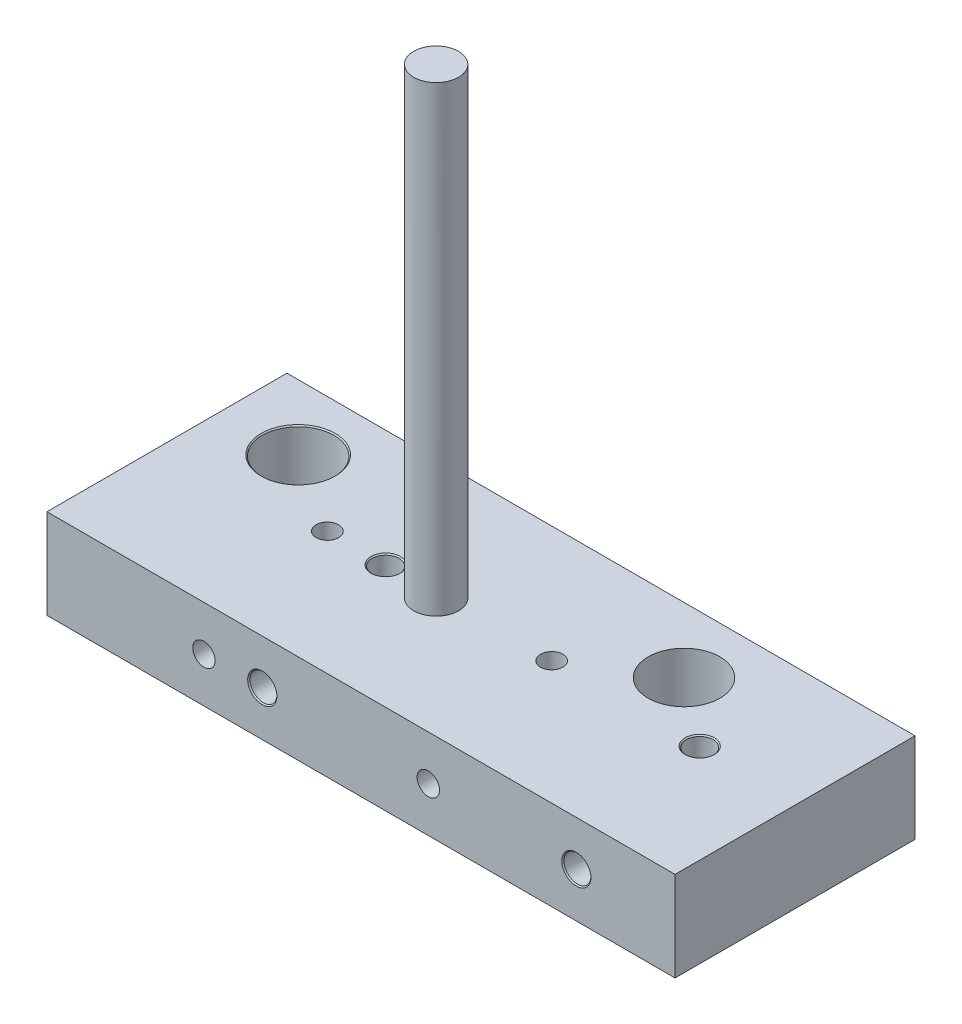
ISO-10303-21;
HEADER;
FILE_DESCRIPTION(('STEP AP214'),'2;1');
FILE_NAME('part.step','',(''),(''),'','','');
FILE_SCHEMA(('AUTOMOTIVE_DESIGN { 1 0 10303 214 1 1 1 1 }'));
ENDSEC;
DATA;
#1=APPLICATION_CONTEXT('core data for automotive mechanical design processes');
#2=APPLICATION_PROTOCOL_DEFINITION('international standard','automotive_design',2000,#1);
#3=PRODUCT_CONTEXT('',#1,'mechanical');
#4=PRODUCT('Part','Part','',(#3));
#5=PRODUCT_RELATED_PRODUCT_CATEGORY('part','',(#4));
#6=PRODUCT_DEFINITION_FORMATION('','',#4);
#7=PRODUCT_DEFINITION_CONTEXT('part definition',#1,'design');
#8=PRODUCT_DEFINITION('design','',#6,#7);
#9=PRODUCT_DEFINITION_SHAPE('','',#8);
#10=(LENGTH_UNIT() NAMED_UNIT(*) SI_UNIT(.MILLI.,.METRE.));
#11=(NAMED_UNIT(*) PLANE_ANGLE_UNIT() SI_UNIT($,.RADIAN.));
#12=(NAMED_UNIT(*) SI_UNIT($,.STERADIAN.) SOLID_ANGLE_UNIT());
#13=UNCERTAINTY_MEASURE_WITH_UNIT(LENGTH_MEASURE(1.E-05),#10,'distance_accuracy_value','');
#14=(GEOMETRIC_REPRESENTATION_CONTEXT(3) GLOBAL_UNCERTAINTY_ASSIGNED_CONTEXT((#13)) GLOBAL_UNIT_ASSIGNED_CONTEXT((#10,
#11,#12)) REPRESENTATION_CONTEXT('',''));
#15=CARTESIAN_POINT('',(0.,0.,0.));
#16=DIRECTION('',(0.,0.,1.));
#17=DIRECTION('',(1.,0.,0.));
#18=AXIS2_PLACEMENT_3D('',#15,#16,#17);
#19=CARTESIAN_POINT('',(0.,20.,-53.5));
#20=DIRECTION('',(0.,-1.,0.));
#21=DIRECTION('',(0.,0.,-1.));
#22=AXIS2_PLACEMENT_3D('',#19,#20,#21);
#23=PLANE('',#22);
#24=CARTESIAN_POINT('',(103.,20.,-39.));
#25=DIRECTION('',(0.,-1.,0.));
#26=DIRECTION('',(0.,0.,-1.));
#27=AXIS2_PLACEMENT_3D('',#24,#25,#26);
#28=CIRCLE('',#27,7.99999999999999);
#29=CARTESIAN_POINT('',(103.,20.,-47.));
#30=VERTEX_POINT('',#29);
#31=EDGE_CURVE('E9178',#30,#30,#28,.T.);
#32=ORIENTED_EDGE('',*,*,#31,.T.);
#33=EDGE_LOOP('',(#32));
#34=FACE_BOUND('',#33,.T.);
#35=DIRECTION('',(0.,0.,1.));
#36=VECTOR('',#35,1.);
#37=CARTESIAN_POINT('',(0.,20.,0.));
#38=LINE('',#37,#36);
#39=CARTESIAN_POINT('',(0.,20.,-53.5));
#40=VERTEX_POINT('',#39);
#41=CARTESIAN_POINT('',(0.,20.,0.));
#42=VERTEX_POINT('',#41);
#43=EDGE_CURVE('E9306',#40,#42,#38,.T.);
#44=ORIENTED_EDGE('',*,*,#43,.T.);
#45=DIRECTION('',(1.,0.,0.));
#46=VECTOR('',#45,1.);
#47=CARTESIAN_POINT('',(0.,20.,0.));
#48=LINE('',#47,#46);
#49=CARTESIAN_POINT('',(140.,20.,0.));
#50=VERTEX_POINT('',#49);
#51=EDGE_CURVE('E9304',#42,#50,#48,.T.);
#52=ORIENTED_EDGE('',*,*,#51,.T.);
#53=DIRECTION('',(0.,0.,-1.));
#54=VECTOR('',#53,1.);
#55=CARTESIAN_POINT('',(140.,20.,0.));
#56=LINE('',#55,#54);
#57=CARTESIAN_POINT('',(140.,20.,-53.5));
#58=VERTEX_POINT('',#57);
#59=EDGE_CURVE('E9302',#50,#58,#56,.T.);
#60=ORIENTED_EDGE('',*,*,#59,.T.);
#61=DIRECTION('',(-1.,0.,0.));
#62=VECTOR('',#61,1.);
#63=CARTESIAN_POINT('',(0.,20.,-53.5));
#64=LINE('',#63,#62);
#65=EDGE_CURVE('E9300',#58,#40,#64,.T.);
#66=ORIENTED_EDGE('',*,*,#65,.T.);
#67=EDGE_LOOP('',(#44,#52,#60,#66));
#68=FACE_BOUND('',#67,.T.);
#69=CARTESIAN_POINT('',(17.,20.,-39.));
#70=DIRECTION('',(0.,-1.,0.));
#71=DIRECTION('',(0.,0.,-1.));
#72=AXIS2_PLACEMENT_3D('',#69,#70,#71);
#73=CIRCLE('',#72,8.24999999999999);
#74=CARTESIAN_POINT('',(17.,20.,-47.25));
#75=VERTEX_POINT('',#74);
#76=EDGE_CURVE('E9327',#75,#75,#73,.T.);
#77=ORIENTED_EDGE('',*,*,#76,.T.);
#78=EDGE_LOOP('',(#77));
#79=FACE_BOUND('',#78,.T.);
#80=CARTESIAN_POINT('',(35.,20.,-27.5));
#81=DIRECTION('',(0.,-1.,0.));
#82=DIRECTION('',(0.,0.,-1.));
#83=AXIS2_PLACEMENT_3D('',#80,#81,#82);
#84=CIRCLE('',#83,2.5);
#85=CARTESIAN_POINT('',(35.,20.,-30.));
#86=VERTEX_POINT('',#85);
#87=EDGE_CURVE('E9333',#86,#86,#84,.T.);
#88=ORIENTED_EDGE('',*,*,#87,.T.);
#89=EDGE_LOOP('',(#88));
#90=FACE_BOUND('',#89,.T.);
#91=CARTESIAN_POINT('',(85.,20.,-27.5));
#92=DIRECTION('',(0.,-1.,0.));
#93=DIRECTION('',(0.,0.,-1.));
#94=AXIS2_PLACEMENT_3D('',#91,#92,#93);
#95=CIRCLE('',#94,2.49999999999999);
#96=CARTESIAN_POINT('',(85.,20.,-30.));
#97=VERTEX_POINT('',#96);
#98=EDGE_CURVE('E9339',#97,#97,#95,.T.);
#99=ORIENTED_EDGE('',*,*,#98,.T.);
#100=EDGE_LOOP('',(#99));
#101=FACE_BOUND('',#100,.T.);
#102=CARTESIAN_POINT('',(48.,20.,-27.5));
#103=DIRECTION('',(0.,-1.,0.));
#104=DIRECTION('',(0.,0.,-1.));
#105=AXIS2_PLACEMENT_3D('',#102,#103,#104);
#106=CIRCLE('',#105,3.25);
#107=CARTESIAN_POINT('',(48.,20.,-30.75));
#108=VERTEX_POINT('',#107);
#109=EDGE_CURVE('E9351',#108,#108,#106,.T.);
#110=ORIENTED_EDGE('',*,*,#109,.T.);
#111=EDGE_LOOP('',(#110));
#112=FACE_BOUND('',#111,.T.);
#113=CARTESIAN_POINT('',(118.,20.,-27.5));
#114=DIRECTION('',(0.,-1.,0.));
#115=DIRECTION('',(0.,0.,-1.));
#116=AXIS2_PLACEMENT_3D('',#113,#114,#115);
#117=CIRCLE('',#116,3.24999999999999);
#118=CARTESIAN_POINT('',(118.,20.,-30.75));
#119=VERTEX_POINT('',#118);
#120=EDGE_CURVE('E9363',#119,#119,#117,.T.);
#121=ORIENTED_EDGE('',*,*,#120,.T.);
#122=EDGE_LOOP('',(#121));
#123=FACE_BOUND('',#122,.T.);
#124=CARTESIAN_POINT('',(60.,20.,-26.75));
#125=DIRECTION('',(0.,-1.,0.));
#126=DIRECTION('',(0.,0.,-1.));
#127=AXIS2_PLACEMENT_3D('',#124,#125,#126);
#128=CIRCLE('',#127,5.);
#129=CARTESIAN_POINT('',(60.,20.,-31.75));
#130=VERTEX_POINT('',#129);
#131=EDGE_CURVE('E11',#130,#130,#128,.F.);
#132=ORIENTED_EDGE('',*,*,#131,.F.);
#133=EDGE_LOOP('',(#132));
#134=FACE_BOUND('',#133,.T.);
#135=ADVANCED_FACE('F9174',(#34,#68,#79,#90,#101,#112,#123,#134),#23,.F.);
#136=CARTESIAN_POINT('',(85.,0.,-27.5));
#137=DIRECTION('',(0.,-1.,0.));
#138=DIRECTION('',(0.,0.,-1.));
#139=AXIS2_PLACEMENT_3D('',#136,#137,#138);
#140=CYLINDRICAL_SURFACE('',#139,2.49999999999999);
#141=CARTESIAN_POINT('',(85.,0.,-27.5));
#142=DIRECTION('',(0.,-1.,0.));
#143=DIRECTION('',(0.,0.,-1.));
#144=AXIS2_PLACEMENT_3D('',#141,#142,#143);
#145=CIRCLE('',#144,2.49999999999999);
#146=CARTESIAN_POINT('',(85.,0.,-30.));
#147=VERTEX_POINT('',#146);
#148=EDGE_CURVE('E9336',#147,#147,#145,.T.);
#149=ORIENTED_EDGE('',*,*,#148,.T.);
#150=EDGE_LOOP('',(#149));
#151=FACE_BOUND('',#150,.T.);
#152=CARTESIAN_POINT('',(85.,10.,-27.5));
#153=DIRECTION('',(0.,-0.707106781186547,-0.707106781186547));
#154=DIRECTION('',(0.,-0.707106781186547,0.707106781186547));
#155=AXIS2_PLACEMENT_3D('',#152,#153,#154);
#156=ELLIPSE('',#155,3.53553390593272,2.49999999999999);
#157=CARTESIAN_POINT('',(82.5,10.,-27.5));
#158=VERTEX_POINT('',#157);
#159=CARTESIAN_POINT('',(87.5,10.,-27.5));
#160=VERTEX_POINT('',#159);
#161=EDGE_CURVE('E9189',#158,#160,#156,.F.);
#162=ORIENTED_EDGE('',*,*,#161,.T.);
#163=CARTESIAN_POINT('',(85.,10.,-27.5));
#164=DIRECTION('',(0.,-0.707106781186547,0.707106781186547));
#165=DIRECTION('',(0.,-0.707106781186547,-0.707106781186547));
#166=AXIS2_PLACEMENT_3D('',#163,#164,#165);
#167=ELLIPSE('',#166,3.53553390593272,2.49999999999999);
#168=EDGE_CURVE('E9183',#160,#158,#167,.F.);
#169=ORIENTED_EDGE('',*,*,#168,.T.);
#170=EDGE_LOOP('',(#162,#169));
#171=FACE_BOUND('',#170,.T.);
#172=ADVANCED_FACE('F9252',(#151,#171),#140,.F.);
#173=CARTESIAN_POINT('',(35.,0.,-27.5));
#174=DIRECTION('',(0.,-1.,0.));
#175=DIRECTION('',(0.,0.,-1.));
#176=AXIS2_PLACEMENT_3D('',#173,#174,#175);
#177=CYLINDRICAL_SURFACE('',#176,2.49999999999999);
#178=CARTESIAN_POINT('',(35.,0.,-27.5));
#179=DIRECTION('',(0.,-1.,0.));
#180=DIRECTION('',(0.,0.,-1.));
#181=AXIS2_PLACEMENT_3D('',#178,#179,#180);
#182=CIRCLE('',#181,2.49999999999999);
#183=CARTESIAN_POINT('',(35.,0.,-30.));
#184=VERTEX_POINT('',#183);
#185=EDGE_CURVE('E9330',#184,#184,#182,.T.);
#186=ORIENTED_EDGE('',*,*,#185,.T.);
#187=EDGE_LOOP('',(#186));
#188=FACE_BOUND('',#187,.T.);
#189=CARTESIAN_POINT('',(35.,10.,-27.5));
#190=DIRECTION('',(0.,-0.707106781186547,-0.707106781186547));
#191=DIRECTION('',(0.,-0.707106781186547,0.707106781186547));
#192=AXIS2_PLACEMENT_3D('',#189,#190,#191);
#193=ELLIPSE('',#192,3.53553390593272,2.49999999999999);
#194=CARTESIAN_POINT('',(32.5,10.,-27.5));
#195=VERTEX_POINT('',#194);
#196=CARTESIAN_POINT('',(37.5,10.,-27.5));
#197=VERTEX_POINT('',#196);
#198=EDGE_CURVE('E9196',#195,#197,#193,.F.);
#199=ORIENTED_EDGE('',*,*,#198,.T.);
#200=CARTESIAN_POINT('',(35.,10.,-27.5));
#201=DIRECTION('',(0.,-0.707106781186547,0.707106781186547));
#202=DIRECTION('',(0.,-0.707106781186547,-0.707106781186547));
#203=AXIS2_PLACEMENT_3D('',#200,#201,#202);
#204=ELLIPSE('',#203,3.53553390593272,2.49999999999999);
#205=EDGE_CURVE('E9250',#197,#195,#204,.F.);
#206=ORIENTED_EDGE('',*,*,#205,.T.);
#207=EDGE_LOOP('',(#199,#206));
#208=FACE_BOUND('',#207,.T.);
#209=ADVANCED_FACE('F9549',(#188,#208),#177,.F.);
#210=CARTESIAN_POINT('',(118.,0.,-27.5));
#211=DIRECTION('',(0.,-1.,0.));
#212=DIRECTION('',(0.,0.,-1.));
#213=AXIS2_PLACEMENT_3D('',#210,#211,#212);
#214=CYLINDRICAL_SURFACE('',#213,3.);
#215=CARTESIAN_POINT('',(118.,0.250000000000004,-27.5));
#216=DIRECTION('',(0.,-1.,0.));
#217=DIRECTION('',(0.,0.,-1.));
#218=AXIS2_PLACEMENT_3D('',#215,#216,#217);
#219=CIRCLE('',#218,3.);
#220=CARTESIAN_POINT('',(118.,0.250000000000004,-30.5));
#221=VERTEX_POINT('',#220);
#222=EDGE_CURVE('E9357',#221,#221,#219,.T.);
#223=ORIENTED_EDGE('',*,*,#222,.T.);
#224=EDGE_LOOP('',(#223));
#225=FACE_BOUND('',#224,.T.);
#226=CARTESIAN_POINT('',(118.,10.,-27.5));
#227=DIRECTION('',(0.,-0.707106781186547,-0.707106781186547));
#228=DIRECTION('',(0.,-0.707106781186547,0.707106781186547));
#229=AXIS2_PLACEMENT_3D('',#226,#227,#228);
#230=ELLIPSE('',#229,4.24264068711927,2.99999999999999);
#231=CARTESIAN_POINT('',(115.,10.,-27.5));
#232=VERTEX_POINT('',#231);
#233=CARTESIAN_POINT('',(121.,10.,-27.5));
#234=VERTEX_POINT('',#233);
#235=EDGE_CURVE('E9275',#232,#234,#230,.F.);
#236=ORIENTED_EDGE('',*,*,#235,.T.);
#237=CARTESIAN_POINT('',(118.,10.,-27.5));
#238=DIRECTION('',(0.,-0.707106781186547,0.707106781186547));
#239=DIRECTION('',(0.,-0.707106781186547,-0.707106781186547));
#240=AXIS2_PLACEMENT_3D('',#237,#238,#239);
#241=ELLIPSE('',#240,4.24264068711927,2.99999999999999);
#242=EDGE_CURVE('E9266',#234,#232,#241,.F.);
#243=ORIENTED_EDGE('',*,*,#242,.T.);
#244=EDGE_LOOP('',(#236,#243));
#245=FACE_BOUND('',#244,.T.);
#246=ADVANCED_FACE('F9525',(#225,#245),#214,.F.);
#247=CARTESIAN_POINT('',(48.,0.,-27.5));
#248=DIRECTION('',(0.,-1.,0.));
#249=DIRECTION('',(0.,0.,-1.));
#250=AXIS2_PLACEMENT_3D('',#247,#248,#249);
#251=CYLINDRICAL_SURFACE('',#250,3.);
#252=CARTESIAN_POINT('',(48.,0.250000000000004,-27.5));
#253=DIRECTION('',(0.,-1.,0.));
#254=DIRECTION('',(0.,0.,-1.));
#255=AXIS2_PLACEMENT_3D('',#252,#253,#254);
#256=CIRCLE('',#255,3.);
#257=CARTESIAN_POINT('',(48.,0.250000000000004,-30.5));
#258=VERTEX_POINT('',#257);
#259=EDGE_CURVE('E9345',#258,#258,#256,.T.);
#260=ORIENTED_EDGE('',*,*,#259,.T.);
#261=EDGE_LOOP('',(#260));
#262=FACE_BOUND('',#261,.T.);
#263=CARTESIAN_POINT('',(48.,10.,-27.5));
#264=DIRECTION('',(0.,-0.707106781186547,-0.707106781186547));
#265=DIRECTION('',(0.,-0.707106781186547,0.707106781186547));
#266=AXIS2_PLACEMENT_3D('',#263,#264,#265);
#267=ELLIPSE('',#266,4.24264068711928,2.99999999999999);
#268=CARTESIAN_POINT('',(45.,10.,-27.5));
#269=VERTEX_POINT('',#268);
#270=CARTESIAN_POINT('',(51.,10.,-27.5));
#271=VERTEX_POINT('',#270);
#272=EDGE_CURVE('E9286',#269,#271,#267,.F.);
#273=ORIENTED_EDGE('',*,*,#272,.T.);
#274=CARTESIAN_POINT('',(48.,10.,-27.5));
#275=DIRECTION('',(0.,-0.707106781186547,0.707106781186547));
#276=DIRECTION('',(0.,-0.707106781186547,-0.707106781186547));
#277=AXIS2_PLACEMENT_3D('',#274,#275,#276);
#278=ELLIPSE('',#277,4.24264068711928,2.99999999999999);
#279=EDGE_CURVE('E9277',#271,#269,#278,.F.);
#280=ORIENTED_EDGE('',*,*,#279,.T.);
#281=EDGE_LOOP('',(#273,#280));
#282=FACE_BOUND('',#281,.T.);
#283=ADVANCED_FACE('F9538',(#262,#282),#251,.F.);
#284=CARTESIAN_POINT('',(0.,20.,0.));
#285=DIRECTION('',(1.,0.,0.));
#286=DIRECTION('',(0.,0.,-1.));
#287=AXIS2_PLACEMENT_3D('',#284,#285,#286);
#288=PLANE('',#287);
#289=DIRECTION('',(0.,0.,1.));
#290=VECTOR('',#289,1.);
#291=CARTESIAN_POINT('',(0.,0.,0.));
#292=LINE('',#291,#290);
#293=CARTESIAN_POINT('',(0.,0.,-53.5));
#294=VERTEX_POINT('',#293);
#295=CARTESIAN_POINT('',(0.,0.,0.));
#296=VERTEX_POINT('',#295);
#297=EDGE_CURVE('E9315',#294,#296,#292,.T.);
#298=ORIENTED_EDGE('',*,*,#297,.T.);
#299=DIRECTION('',(0.,-1.,0.));
#300=VECTOR('',#299,1.);
#301=CARTESIAN_POINT('',(0.,20.,0.));
#302=LINE('',#301,#300);
#303=EDGE_CURVE('E9288',#42,#296,#302,.T.);
#304=ORIENTED_EDGE('',*,*,#303,.F.);
#305=ORIENTED_EDGE('',*,*,#43,.F.);
#306=DIRECTION('',(0.,-1.,0.));
#307=VECTOR('',#306,1.);
#308=CARTESIAN_POINT('',(0.,20.,-53.5));
#309=LINE('',#308,#307);
#310=EDGE_CURVE('E9297',#40,#294,#309,.T.);
#311=ORIENTED_EDGE('',*,*,#310,.T.);
#312=EDGE_LOOP('',(#298,#304,#305,#311));
#313=FACE_BOUND('',#312,.T.);
#314=ADVANCED_FACE('F9176',(#313),#288,.F.);
#315=CARTESIAN_POINT('',(0.,20.,0.));
#316=DIRECTION('',(0.,0.,-1.));
#317=DIRECTION('',(-1.,0.,0.));
#318=AXIS2_PLACEMENT_3D('',#315,#316,#317);
#319=PLANE('',#318);
#320=CARTESIAN_POINT('',(85.,10.,0.));
#321=DIRECTION('',(0.,0.,1.));
#322=DIRECTION('',(1.,0.,0.));
#323=AXIS2_PLACEMENT_3D('',#320,#321,#322);
#324=CIRCLE('',#323,2.49999999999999);
#325=CARTESIAN_POINT('',(87.5,10.,0.));
#326=VERTEX_POINT('',#325);
#327=EDGE_CURVE('E9396',#326,#326,#324,.T.);
#328=ORIENTED_EDGE('',*,*,#327,.F.);
#329=EDGE_LOOP('',(#328));
#330=FACE_BOUND('',#329,.T.);
#331=CARTESIAN_POINT('',(35.,10.,0.));
#332=DIRECTION('',(0.,0.,1.));
#333=DIRECTION('',(1.,0.,0.));
#334=AXIS2_PLACEMENT_3D('',#331,#332,#333);
#335=CIRCLE('',#334,2.49999999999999);
#336=CARTESIAN_POINT('',(37.5,10.,0.));
#337=VERTEX_POINT('',#336);
#338=EDGE_CURVE('E9390',#337,#337,#335,.T.);
#339=ORIENTED_EDGE('',*,*,#338,.F.);
#340=EDGE_LOOP('',(#339));
#341=FACE_BOUND('',#340,.T.);
#342=CARTESIAN_POINT('',(118.,10.,0.));
#343=DIRECTION('',(0.,0.,1.));
#344=DIRECTION('',(1.,0.,0.));
#345=AXIS2_PLACEMENT_3D('',#342,#343,#344);
#346=CIRCLE('',#345,3.25);
#347=CARTESIAN_POINT('',(121.25,10.,0.));
#348=VERTEX_POINT('',#347);
#349=EDGE_CURVE('E9378',#348,#348,#346,.T.);
#350=ORIENTED_EDGE('',*,*,#349,.F.);
#351=EDGE_LOOP('',(#350));
#352=FACE_BOUND('',#351,.T.);
#353=CARTESIAN_POINT('',(48.,10.,0.));
#354=DIRECTION('',(0.,0.,1.));
#355=DIRECTION('',(1.,0.,0.));
#356=AXIS2_PLACEMENT_3D('',#353,#354,#355);
#357=CIRCLE('',#356,3.25);
#358=CARTESIAN_POINT('',(51.25,10.,0.));
#359=VERTEX_POINT('',#358);
#360=EDGE_CURVE('E9366',#359,#359,#357,.T.);
#361=ORIENTED_EDGE('',*,*,#360,.F.);
#362=EDGE_LOOP('',(#361));
#363=FACE_BOUND('',#362,.T.);
#364=DIRECTION('',(1.,0.,0.));
#365=VECTOR('',#364,1.);
#366=CARTESIAN_POINT('',(0.,0.,0.));
#367=LINE('',#366,#365);
#368=CARTESIAN_POINT('',(140.,0.,0.));
#369=VERTEX_POINT('',#368);
#370=EDGE_CURVE('E9313',#296,#369,#367,.T.);
#371=ORIENTED_EDGE('',*,*,#370,.T.);
#372=DIRECTION('',(0.,-1.,0.));
#373=VECTOR('',#372,1.);
#374=CARTESIAN_POINT('',(140.,20.,0.));
#375=LINE('',#374,#373);
#376=EDGE_CURVE('E9291',#50,#369,#375,.T.);
#377=ORIENTED_EDGE('',*,*,#376,.F.);
#378=ORIENTED_EDGE('',*,*,#51,.F.);
#379=ORIENTED_EDGE('',*,*,#303,.T.);
#380=EDGE_LOOP('',(#371,#377,#378,#379));
#381=FACE_BOUND('',#380,.T.);
#382=ADVANCED_FACE('F9452',(#330,#341,#352,#363,#381),#319,.F.);
#383=CARTESIAN_POINT('',(140.,20.,0.));
#384=DIRECTION('',(-1.,0.,0.));
#385=DIRECTION('',(0.,0.,1.));
#386=AXIS2_PLACEMENT_3D('',#383,#384,#385);
#387=PLANE('',#386);
#388=DIRECTION('',(0.,0.,-1.));
#389=VECTOR('',#388,1.);
#390=CARTESIAN_POINT('',(140.,0.,0.));
#391=LINE('',#390,#389);
#392=CARTESIAN_POINT('',(140.,0.,-53.5));
#393=VERTEX_POINT('',#392);
#394=EDGE_CURVE('E9311',#369,#393,#391,.T.);
#395=ORIENTED_EDGE('',*,*,#394,.T.);
#396=DIRECTION('',(0.,-1.,0.));
#397=VECTOR('',#396,1.);
#398=CARTESIAN_POINT('',(140.,20.,-53.5));
#399=LINE('',#398,#397);
#400=EDGE_CURVE('E9294',#58,#393,#399,.T.);
#401=ORIENTED_EDGE('',*,*,#400,.F.);
#402=ORIENTED_EDGE('',*,*,#59,.F.);
#403=ORIENTED_EDGE('',*,*,#376,.T.);
#404=EDGE_LOOP('',(#395,#401,#402,#403));
#405=FACE_BOUND('',#404,.T.);
#406=ADVANCED_FACE('F9449',(#405),#387,.F.);
#407=CARTESIAN_POINT('',(0.,20.,-53.5));
#408=DIRECTION('',(0.,0.,1.));
#409=DIRECTION('',(1.,0.,0.));
#410=AXIS2_PLACEMENT_3D('',#407,#408,#409);
#411=PLANE('',#410);
#412=CARTESIAN_POINT('',(85.,10.,-53.5));
#413=DIRECTION('',(0.,0.,1.));
#414=DIRECTION('',(1.,0.,0.));
#415=AXIS2_PLACEMENT_3D('',#412,#413,#414);
#416=CIRCLE('',#415,2.49999999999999);
#417=CARTESIAN_POINT('',(87.5,10.,-53.5));
#418=VERTEX_POINT('',#417);
#419=EDGE_CURVE('E9399',#418,#418,#416,.T.);
#420=ORIENTED_EDGE('',*,*,#419,.T.);
#421=EDGE_LOOP('',(#420));
#422=FACE_BOUND('',#421,.T.);
#423=CARTESIAN_POINT('',(35.,10.,-53.5));
#424=DIRECTION('',(0.,0.,1.));
#425=DIRECTION('',(1.,0.,0.));
#426=AXIS2_PLACEMENT_3D('',#423,#424,#425);
#427=CIRCLE('',#426,2.49999999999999);
#428=CARTESIAN_POINT('',(37.5,10.,-53.5));
#429=VERTEX_POINT('',#428);
#430=EDGE_CURVE('E9393',#429,#429,#427,.T.);
#431=ORIENTED_EDGE('',*,*,#430,.T.);
#432=EDGE_LOOP('',(#431));
#433=FACE_BOUND('',#432,.T.);
#434=CARTESIAN_POINT('',(118.,10.,-53.5));
#435=DIRECTION('',(0.,0.,1.));
#436=DIRECTION('',(1.,0.,0.));
#437=AXIS2_PLACEMENT_3D('',#434,#435,#436);
#438=CIRCLE('',#437,3.24999999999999);
#439=CARTESIAN_POINT('',(121.25,10.,-53.5));
#440=VERTEX_POINT('',#439);
#441=EDGE_CURVE('E9387',#440,#440,#438,.T.);
#442=ORIENTED_EDGE('',*,*,#441,.T.);
#443=EDGE_LOOP('',(#442));
#444=FACE_BOUND('',#443,.T.);
#445=CARTESIAN_POINT('',(48.,10.,-53.5));
#446=DIRECTION('',(0.,0.,1.));
#447=DIRECTION('',(1.,0.,0.));
#448=AXIS2_PLACEMENT_3D('',#445,#446,#447);
#449=CIRCLE('',#448,3.24999999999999);
#450=CARTESIAN_POINT('',(51.25,10.,-53.5));
#451=VERTEX_POINT('',#450);
#452=EDGE_CURVE('E9375',#451,#451,#449,.T.);
#453=ORIENTED_EDGE('',*,*,#452,.T.);
#454=EDGE_LOOP('',(#453));
#455=FACE_BOUND('',#454,.T.);
#456=DIRECTION('',(-1.,0.,0.));
#457=VECTOR('',#456,1.);
#458=CARTESIAN_POINT('',(0.,0.,-53.5));
#459=LINE('',#458,#457);
#460=EDGE_CURVE('E9309',#393,#294,#459,.T.);
#461=ORIENTED_EDGE('',*,*,#460,.T.);
#462=ORIENTED_EDGE('',*,*,#310,.F.);
#463=ORIENTED_EDGE('',*,*,#65,.F.);
#464=ORIENTED_EDGE('',*,*,#400,.T.);
#465=EDGE_LOOP('',(#461,#462,#463,#464));
#466=FACE_BOUND('',#465,.T.);
#467=ADVANCED_FACE('F9425',(#422,#433,#444,#455,#466),#411,.F.);
#468=CARTESIAN_POINT('',(0.,0.,-53.5));
#469=DIRECTION('',(0.,-1.,0.));
#470=DIRECTION('',(0.,0.,-1.));
#471=AXIS2_PLACEMENT_3D('',#468,#469,#470);
#472=PLANE('',#471);
#473=CARTESIAN_POINT('',(103.,0.,-39.));
#474=DIRECTION('',(0.,-1.,0.));
#475=DIRECTION('',(0.,0.,-1.));
#476=AXIS2_PLACEMENT_3D('',#473,#474,#475);
#477=CIRCLE('',#476,8.25000000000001);
#478=CARTESIAN_POINT('',(103.,0.,-47.25));
#479=VERTEX_POINT('',#478);
#480=EDGE_CURVE('E9405',#479,#479,#477,.T.);
#481=ORIENTED_EDGE('',*,*,#480,.F.);
#482=EDGE_LOOP('',(#481));
#483=FACE_BOUND('',#482,.T.);
#484=CARTESIAN_POINT('',(118.,0.,-27.5));
#485=DIRECTION('',(0.,-1.,0.));
#486=DIRECTION('',(0.,0.,-1.));
#487=AXIS2_PLACEMENT_3D('',#484,#485,#486);
#488=CIRCLE('',#487,3.25);
#489=CARTESIAN_POINT('',(118.,0.,-30.75));
#490=VERTEX_POINT('',#489);
#491=EDGE_CURVE('E9354',#490,#490,#488,.T.);
#492=ORIENTED_EDGE('',*,*,#491,.F.);
#493=EDGE_LOOP('',(#492));
#494=FACE_BOUND('',#493,.T.);
#495=CARTESIAN_POINT('',(48.,0.,-27.5));
#496=DIRECTION('',(0.,-1.,0.));
#497=DIRECTION('',(0.,0.,-1.));
#498=AXIS2_PLACEMENT_3D('',#495,#496,#497);
#499=CIRCLE('',#498,3.25);
#500=CARTESIAN_POINT('',(48.,0.,-30.75));
#501=VERTEX_POINT('',#500);
#502=EDGE_CURVE('E9342',#501,#501,#499,.T.);
#503=ORIENTED_EDGE('',*,*,#502,.F.);
#504=EDGE_LOOP('',(#503));
#505=FACE_BOUND('',#504,.T.);
#506=ORIENTED_EDGE('',*,*,#148,.F.);
#507=EDGE_LOOP('',(#506));
#508=FACE_BOUND('',#507,.T.);
#509=ORIENTED_EDGE('',*,*,#185,.F.);
#510=EDGE_LOOP('',(#509));
#511=FACE_BOUND('',#510,.T.);
#512=CARTESIAN_POINT('',(17.,0.,-39.));
#513=DIRECTION('',(0.,-1.,0.));
#514=DIRECTION('',(0.,0.,-1.));
#515=AXIS2_PLACEMENT_3D('',#512,#513,#514);
#516=CIRCLE('',#515,8.25);
#517=CARTESIAN_POINT('',(17.,0.,-47.25));
#518=VERTEX_POINT('',#517);
#519=EDGE_CURVE('E9318',#518,#518,#516,.T.);
#520=ORIENTED_EDGE('',*,*,#519,.F.);
#521=EDGE_LOOP('',(#520));
#522=FACE_BOUND('',#521,.T.);
#523=ORIENTED_EDGE('',*,*,#297,.F.);
#524=ORIENTED_EDGE('',*,*,#460,.F.);
#525=ORIENTED_EDGE('',*,*,#394,.F.);
#526=ORIENTED_EDGE('',*,*,#370,.F.);
#527=EDGE_LOOP('',(#523,#524,#525,#526));
#528=FACE_BOUND('',#527,.T.);
#529=ADVANCED_FACE('F9421',(#483,#494,#505,#508,#511,#522,#528),#472,.T.);
#530=CARTESIAN_POINT('',(17.,0.,-39.));
#531=DIRECTION('',(0.,-1.,0.));
#532=DIRECTION('',(0.,0.,-1.));
#533=AXIS2_PLACEMENT_3D('',#530,#531,#532);
#534=CONICAL_SURFACE('',#533,8.25,0.785398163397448);
#535=CARTESIAN_POINT('',(17.,0.250000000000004,-39.));
#536=DIRECTION('',(0.,-1.,0.));
#537=DIRECTION('',(0.,0.,-1.));
#538=AXIS2_PLACEMENT_3D('',#535,#536,#537);
#539=CIRCLE('',#538,8.);
#540=CARTESIAN_POINT('',(17.,0.250000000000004,-47.));
#541=VERTEX_POINT('',#540);
#542=EDGE_CURVE('E9321',#541,#541,#539,.T.);
#543=ORIENTED_EDGE('',*,*,#542,.F.);
#544=EDGE_LOOP('',(#543));
#545=FACE_BOUND('',#544,.T.);
#546=ORIENTED_EDGE('',*,*,#519,.T.);
#547=EDGE_LOOP('',(#546));
#548=FACE_BOUND('',#547,.T.);
#549=ADVANCED_FACE('F9424',(#545,#548),#534,.F.);
#550=CARTESIAN_POINT('',(17.,0.,-39.));
#551=DIRECTION('',(0.,-1.,0.));
#552=DIRECTION('',(0.,0.,-1.));
#553=AXIS2_PLACEMENT_3D('',#550,#551,#552);
#554=CYLINDRICAL_SURFACE('',#553,7.99999999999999);
#555=CARTESIAN_POINT('',(17.,19.75,-39.));
#556=DIRECTION('',(0.,-1.,0.));
#557=DIRECTION('',(0.,0.,-1.));
#558=AXIS2_PLACEMENT_3D('',#555,#556,#557);
#559=CIRCLE('',#558,7.99999999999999);
#560=CARTESIAN_POINT('',(17.,19.75,-47.));
#561=VERTEX_POINT('',#560);
#562=EDGE_CURVE('E9324',#561,#561,#559,.T.);
#563=ORIENTED_EDGE('',*,*,#562,.F.);
#564=EDGE_LOOP('',(#563));
#565=FACE_BOUND('',#564,.T.);
#566=ORIENTED_EDGE('',*,*,#542,.T.);
#567=EDGE_LOOP('',(#566));
#568=FACE_BOUND('',#567,.T.);
#569=ADVANCED_FACE('F9552',(#565,#568),#554,.F.);
#570=CARTESIAN_POINT('',(17.,19.75,-39.));
#571=DIRECTION('',(0.,1.,0.));
#572=DIRECTION('',(0.,0.,1.));
#573=AXIS2_PLACEMENT_3D('',#570,#571,#572);
#574=CONICAL_SURFACE('',#573,7.99999999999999,0.785398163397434);
#575=ORIENTED_EDGE('',*,*,#76,.F.);
#576=EDGE_LOOP('',(#575));
#577=FACE_BOUND('',#576,.T.);
#578=ORIENTED_EDGE('',*,*,#562,.T.);
#579=EDGE_LOOP('',(#578));
#580=FACE_BOUND('',#579,.T.);
#581=ADVANCED_FACE('F9547',(#577,#580),#574,.F.);
#582=CARTESIAN_POINT('',(35.,10.,-27.5));
#583=DIRECTION('',(0.,-0.707106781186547,-0.707106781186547));
#584=DIRECTION('',(0.,-0.707106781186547,0.707106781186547));
#585=AXIS2_PLACEMENT_3D('',#582,#583,#584);
#586=ELLIPSE('',#585,3.53553390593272,2.49999999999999);
#587=EDGE_CURVE('E9262',#195,#197,#586,.T.);
#588=ORIENTED_EDGE('',*,*,#587,.T.);
#589=CARTESIAN_POINT('',(35.,10.,-27.5));
#590=DIRECTION('',(0.,-0.707106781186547,0.707106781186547));
#591=DIRECTION('',(0.,-0.707106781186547,-0.707106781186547));
#592=AXIS2_PLACEMENT_3D('',#589,#590,#591);
#593=ELLIPSE('',#592,3.53553390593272,2.49999999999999);
#594=EDGE_CURVE('E9259',#197,#195,#593,.T.);
#595=ORIENTED_EDGE('',*,*,#594,.T.);
#596=EDGE_LOOP('',(#588,#595));
#597=FACE_BOUND('',#596,.T.);
#598=ORIENTED_EDGE('',*,*,#87,.F.);
#599=EDGE_LOOP('',(#598));
#600=FACE_BOUND('',#599,.T.);
#601=ADVANCED_FACE('F9544',(#597,#600),#177,.F.);
#602=CARTESIAN_POINT('',(85.,10.,-27.5));
#603=DIRECTION('',(0.,-0.707106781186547,-0.707106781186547));
#604=DIRECTION('',(0.,-0.707106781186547,0.707106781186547));
#605=AXIS2_PLACEMENT_3D('',#602,#603,#604);
#606=ELLIPSE('',#605,3.53553390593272,2.49999999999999);
#607=EDGE_CURVE('E9242',#158,#160,#606,.T.);
#608=ORIENTED_EDGE('',*,*,#607,.T.);
#609=CARTESIAN_POINT('',(85.,10.,-27.5));
#610=DIRECTION('',(0.,-0.707106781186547,0.707106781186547));
#611=DIRECTION('',(0.,-0.707106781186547,-0.707106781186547));
#612=AXIS2_PLACEMENT_3D('',#609,#610,#611);
#613=ELLIPSE('',#612,3.53553390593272,2.49999999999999);
#614=EDGE_CURVE('E9246',#160,#158,#613,.T.);
#615=ORIENTED_EDGE('',*,*,#614,.T.);
#616=EDGE_LOOP('',(#608,#615));
#617=FACE_BOUND('',#616,.T.);
#618=ORIENTED_EDGE('',*,*,#98,.F.);
#619=EDGE_LOOP('',(#618));
#620=FACE_BOUND('',#619,.T.);
#621=ADVANCED_FACE('F9254',(#617,#620),#140,.F.);
#622=CARTESIAN_POINT('',(48.,0.,-27.5));
#623=DIRECTION('',(0.,-1.,0.));
#624=DIRECTION('',(0.,0.,-1.));
#625=AXIS2_PLACEMENT_3D('',#622,#623,#624);
#626=CONICAL_SURFACE('',#625,3.25,0.785398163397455);
#627=ORIENTED_EDGE('',*,*,#259,.F.);
#628=EDGE_LOOP('',(#627));
#629=FACE_BOUND('',#628,.T.);
#630=ORIENTED_EDGE('',*,*,#502,.T.);
#631=EDGE_LOOP('',(#630));
#632=FACE_BOUND('',#631,.T.);
#633=ADVANCED_FACE('F9536',(#629,#632),#626,.F.);
#634=CARTESIAN_POINT('',(48.,10.,-27.5));
#635=DIRECTION('',(0.,-0.707106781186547,-0.707106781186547));
#636=DIRECTION('',(0.,-0.707106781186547,0.707106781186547));
#637=AXIS2_PLACEMENT_3D('',#634,#635,#636);
#638=ELLIPSE('',#637,4.24264068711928,2.99999999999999);
#639=EDGE_CURVE('E9283',#269,#271,#638,.T.);
#640=ORIENTED_EDGE('',*,*,#639,.T.);
#641=CARTESIAN_POINT('',(48.,10.,-27.5));
#642=DIRECTION('',(0.,-0.707106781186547,0.707106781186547));
#643=DIRECTION('',(0.,-0.707106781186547,-0.707106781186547));
#644=AXIS2_PLACEMENT_3D('',#641,#642,#643);
#645=ELLIPSE('',#644,4.24264068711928,2.99999999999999);
#646=EDGE_CURVE('E9280',#271,#269,#645,.T.);
#647=ORIENTED_EDGE('',*,*,#646,.T.);
#648=EDGE_LOOP('',(#640,#647));
#649=FACE_BOUND('',#648,.T.);
#650=CARTESIAN_POINT('',(48.,19.75,-27.5));
#651=DIRECTION('',(0.,-1.,0.));
#652=DIRECTION('',(0.,0.,-1.));
#653=AXIS2_PLACEMENT_3D('',#650,#651,#652);
#654=CIRCLE('',#653,3.);
#655=CARTESIAN_POINT('',(48.,19.75,-30.5));
#656=VERTEX_POINT('',#655);
#657=EDGE_CURVE('E9348',#656,#656,#654,.T.);
#658=ORIENTED_EDGE('',*,*,#657,.F.);
#659=EDGE_LOOP('',(#658));
#660=FACE_BOUND('',#659,.T.);
#661=ADVANCED_FACE('F9532',(#649,#660),#251,.F.);
#662=CARTESIAN_POINT('',(48.,19.75,-27.5));
#663=DIRECTION('',(0.,1.,0.));
#664=DIRECTION('',(0.,0.,1.));
#665=AXIS2_PLACEMENT_3D('',#662,#663,#664);
#666=CONICAL_SURFACE('',#665,3.,0.785398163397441);
#667=ORIENTED_EDGE('',*,*,#109,.F.);
#668=EDGE_LOOP('',(#667));
#669=FACE_BOUND('',#668,.T.);
#670=ORIENTED_EDGE('',*,*,#657,.T.);
#671=EDGE_LOOP('',(#670));
#672=FACE_BOUND('',#671,.T.);
#673=ADVANCED_FACE('F9528',(#669,#672),#666,.F.);
#674=CARTESIAN_POINT('',(118.,0.,-27.5));
#675=DIRECTION('',(0.,-1.,0.));
#676=DIRECTION('',(0.,0.,-1.));
#677=AXIS2_PLACEMENT_3D('',#674,#675,#676);
#678=CONICAL_SURFACE('',#677,3.25,0.785398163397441);
#679=ORIENTED_EDGE('',*,*,#222,.F.);
#680=EDGE_LOOP('',(#679));
#681=FACE_BOUND('',#680,.T.);
#682=ORIENTED_EDGE('',*,*,#491,.T.);
#683=EDGE_LOOP('',(#682));
#684=FACE_BOUND('',#683,.T.);
#685=ADVANCED_FACE('F9523',(#681,#684),#678,.F.);
#686=CARTESIAN_POINT('',(118.,10.,-27.5));
#687=DIRECTION('',(0.,-0.707106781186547,-0.707106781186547));
#688=DIRECTION('',(0.,-0.707106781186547,0.707106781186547));
#689=AXIS2_PLACEMENT_3D('',#686,#687,#688);
#690=ELLIPSE('',#689,4.24264068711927,2.99999999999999);
#691=EDGE_CURVE('E9272',#232,#234,#690,.T.);
#692=ORIENTED_EDGE('',*,*,#691,.T.);
#693=CARTESIAN_POINT('',(118.,10.,-27.5));
#694=DIRECTION('',(0.,-0.707106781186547,0.707106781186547));
#695=DIRECTION('',(0.,-0.707106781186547,-0.707106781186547));
#696=AXIS2_PLACEMENT_3D('',#693,#694,#695);
#697=ELLIPSE('',#696,4.24264068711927,2.99999999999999);
#698=EDGE_CURVE('E9269',#234,#232,#697,.T.);
#699=ORIENTED_EDGE('',*,*,#698,.T.);
#700=EDGE_LOOP('',(#692,#699));
#701=FACE_BOUND('',#700,.T.);
#702=CARTESIAN_POINT('',(118.,19.75,-27.5));
#703=DIRECTION('',(0.,-1.,0.));
#704=DIRECTION('',(0.,0.,-1.));
#705=AXIS2_PLACEMENT_3D('',#702,#703,#704);
#706=CIRCLE('',#705,2.99999999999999);
#707=CARTESIAN_POINT('',(118.,19.75,-30.5));
#708=VERTEX_POINT('',#707);
#709=EDGE_CURVE('E9360',#708,#708,#706,.T.);
#710=ORIENTED_EDGE('',*,*,#709,.F.);
#711=EDGE_LOOP('',(#710));
#712=FACE_BOUND('',#711,.T.);
#713=ADVANCED_FACE('F9519',(#701,#712),#214,.F.);
#714=CARTESIAN_POINT('',(118.,19.75,-27.5));
#715=DIRECTION('',(0.,1.,0.));
#716=DIRECTION('',(0.,0.,1.));
#717=AXIS2_PLACEMENT_3D('',#714,#715,#716);
#718=CONICAL_SURFACE('',#717,2.99999999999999,0.785398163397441);
#719=ORIENTED_EDGE('',*,*,#120,.F.);
#720=EDGE_LOOP('',(#719));
#721=FACE_BOUND('',#720,.T.);
#722=ORIENTED_EDGE('',*,*,#709,.T.);
#723=EDGE_LOOP('',(#722));
#724=FACE_BOUND('',#723,.T.);
#725=ADVANCED_FACE('F9516',(#721,#724),#718,.F.);
#726=CARTESIAN_POINT('',(48.,10.,0.));
#727=DIRECTION('',(0.,0.,1.));
#728=DIRECTION('',(1.,0.,0.));
#729=AXIS2_PLACEMENT_3D('',#726,#727,#728);
#730=CYLINDRICAL_SURFACE('',#729,2.99999999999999);
#731=CARTESIAN_POINT('',(48.,10.,-0.250000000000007));
#732=DIRECTION('',(0.,0.,1.));
#733=DIRECTION('',(1.,0.,0.));
#734=AXIS2_PLACEMENT_3D('',#731,#732,#733);
#735=CIRCLE('',#734,3.);
#736=CARTESIAN_POINT('',(51.,10.,-0.250000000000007));
#737=VERTEX_POINT('',#736);
#738=EDGE_CURVE('E9369',#737,#737,#735,.T.);
#739=ORIENTED_EDGE('',*,*,#738,.T.);
#740=EDGE_LOOP('',(#739));
#741=FACE_BOUND('',#740,.T.);
#742=ORIENTED_EDGE('',*,*,#272,.F.);
#743=ORIENTED_EDGE('',*,*,#646,.F.);
#744=EDGE_LOOP('',(#742,#743));
#745=FACE_BOUND('',#744,.T.);
#746=ADVANCED_FACE('F9512',(#741,#745),#730,.F.);
#747=CARTESIAN_POINT('',(48.,10.,0.));
#748=DIRECTION('',(0.,0.,1.));
#749=DIRECTION('',(1.,0.,0.));
#750=AXIS2_PLACEMENT_3D('',#747,#748,#749);
#751=CONICAL_SURFACE('',#750,3.25,0.785398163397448);
#752=ORIENTED_EDGE('',*,*,#738,.F.);
#753=EDGE_LOOP('',(#752));
#754=FACE_BOUND('',#753,.T.);
#755=ORIENTED_EDGE('',*,*,#360,.T.);
#756=EDGE_LOOP('',(#755));
#757=FACE_BOUND('',#756,.T.);
#758=ADVANCED_FACE('F9510',(#754,#757),#751,.F.);
#759=CARTESIAN_POINT('',(48.,10.,-53.25));
#760=DIRECTION('',(0.,0.,1.));
#761=DIRECTION('',(1.,0.,0.));
#762=AXIS2_PLACEMENT_3D('',#759,#760,#761);
#763=CIRCLE('',#762,2.99999999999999);
#764=CARTESIAN_POINT('',(51.,10.,-53.25));
#765=VERTEX_POINT('',#764);
#766=EDGE_CURVE('E9372',#765,#765,#763,.T.);
#767=ORIENTED_EDGE('',*,*,#766,.F.);
#768=EDGE_LOOP('',(#767));
#769=FACE_BOUND('',#768,.T.);
#770=ORIENTED_EDGE('',*,*,#639,.F.);
#771=ORIENTED_EDGE('',*,*,#279,.F.);
#772=EDGE_LOOP('',(#770,#771));
#773=FACE_BOUND('',#772,.T.);
#774=ADVANCED_FACE('F9506',(#769,#773),#730,.F.);
#775=CARTESIAN_POINT('',(48.,10.,-53.25));
#776=DIRECTION('',(0.,0.,-1.));
#777=DIRECTION('',(-1.,0.,0.));
#778=AXIS2_PLACEMENT_3D('',#775,#776,#777);
#779=CONICAL_SURFACE('',#778,2.99999999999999,0.785398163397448);
#780=ORIENTED_EDGE('',*,*,#452,.F.);
#781=EDGE_LOOP('',(#780));
#782=FACE_BOUND('',#781,.T.);
#783=ORIENTED_EDGE('',*,*,#766,.T.);
#784=EDGE_LOOP('',(#783));
#785=FACE_BOUND('',#784,.T.);
#786=ADVANCED_FACE('F9503',(#782,#785),#779,.F.);
#787=CARTESIAN_POINT('',(118.,10.,0.));
#788=DIRECTION('',(0.,0.,1.));
#789=DIRECTION('',(1.,0.,0.));
#790=AXIS2_PLACEMENT_3D('',#787,#788,#789);
#791=CYLINDRICAL_SURFACE('',#790,2.99999999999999);
#792=CARTESIAN_POINT('',(118.,10.,-0.250000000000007));
#793=DIRECTION('',(0.,0.,1.));
#794=DIRECTION('',(1.,0.,0.));
#795=AXIS2_PLACEMENT_3D('',#792,#793,#794);
#796=CIRCLE('',#795,2.99999999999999);
#797=CARTESIAN_POINT('',(121.,10.,-0.250000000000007));
#798=VERTEX_POINT('',#797);
#799=EDGE_CURVE('E9381',#798,#798,#796,.T.);
#800=ORIENTED_EDGE('',*,*,#799,.T.);
#801=EDGE_LOOP('',(#800));
#802=FACE_BOUND('',#801,.T.);
#803=ORIENTED_EDGE('',*,*,#235,.F.);
#804=ORIENTED_EDGE('',*,*,#698,.F.);
#805=EDGE_LOOP('',(#803,#804));
#806=FACE_BOUND('',#805,.T.);
#807=ADVANCED_FACE('F9499',(#802,#806),#791,.F.);
#808=CARTESIAN_POINT('',(118.,10.,0.));
#809=DIRECTION('',(0.,0.,1.));
#810=DIRECTION('',(1.,0.,0.));
#811=AXIS2_PLACEMENT_3D('',#808,#809,#810);
#812=CONICAL_SURFACE('',#811,3.25,0.785398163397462);
#813=ORIENTED_EDGE('',*,*,#799,.F.);
#814=EDGE_LOOP('',(#813));
#815=FACE_BOUND('',#814,.T.);
#816=ORIENTED_EDGE('',*,*,#349,.T.);
#817=EDGE_LOOP('',(#816));
#818=FACE_BOUND('',#817,.T.);
#819=ADVANCED_FACE('F9497',(#815,#818),#812,.F.);
#820=CARTESIAN_POINT('',(118.,10.,-53.25));
#821=DIRECTION('',(0.,0.,1.));
#822=DIRECTION('',(1.,0.,0.));
#823=AXIS2_PLACEMENT_3D('',#820,#821,#822);
#824=CIRCLE('',#823,2.99999999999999);
#825=CARTESIAN_POINT('',(121.,10.,-53.25));
#826=VERTEX_POINT('',#825);
#827=EDGE_CURVE('E9384',#826,#826,#824,.T.);
#828=ORIENTED_EDGE('',*,*,#827,.F.);
#829=EDGE_LOOP('',(#828));
#830=FACE_BOUND('',#829,.T.);
#831=ORIENTED_EDGE('',*,*,#691,.F.);
#832=ORIENTED_EDGE('',*,*,#242,.F.);
#833=EDGE_LOOP('',(#831,#832));
#834=FACE_BOUND('',#833,.T.);
#835=ADVANCED_FACE('F9493',(#830,#834),#791,.F.);
#836=CARTESIAN_POINT('',(118.,10.,-53.25));
#837=DIRECTION('',(0.,0.,-1.));
#838=DIRECTION('',(-1.,0.,0.));
#839=AXIS2_PLACEMENT_3D('',#836,#837,#838);
#840=CONICAL_SURFACE('',#839,2.99999999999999,0.785398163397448);
#841=ORIENTED_EDGE('',*,*,#441,.F.);
#842=EDGE_LOOP('',(#841));
#843=FACE_BOUND('',#842,.T.);
#844=ORIENTED_EDGE('',*,*,#827,.T.);
#845=EDGE_LOOP('',(#844));
#846=FACE_BOUND('',#845,.T.);
#847=ADVANCED_FACE('F9490',(#843,#846),#840,.F.);
#848=CARTESIAN_POINT('',(35.,10.,0.));
#849=DIRECTION('',(0.,0.,1.));
#850=DIRECTION('',(1.,0.,0.));
#851=AXIS2_PLACEMENT_3D('',#848,#849,#850);
#852=CYLINDRICAL_SURFACE('',#851,2.49999999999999);
#853=ORIENTED_EDGE('',*,*,#338,.T.);
#854=EDGE_LOOP('',(#853));
#855=FACE_BOUND('',#854,.T.);
#856=ORIENTED_EDGE('',*,*,#198,.F.);
#857=ORIENTED_EDGE('',*,*,#594,.F.);
#858=EDGE_LOOP('',(#856,#857));
#859=FACE_BOUND('',#858,.T.);
#860=ADVANCED_FACE('F9488',(#855,#859),#852,.F.);
#861=ORIENTED_EDGE('',*,*,#430,.F.);
#862=EDGE_LOOP('',(#861));
#863=FACE_BOUND('',#862,.T.);
#864=ORIENTED_EDGE('',*,*,#587,.F.);
#865=ORIENTED_EDGE('',*,*,#205,.F.);
#866=EDGE_LOOP('',(#864,#865));
#867=FACE_BOUND('',#866,.T.);
#868=ADVANCED_FACE('F9485',(#863,#867),#852,.F.);
#869=CARTESIAN_POINT('',(85.,10.,0.));
#870=DIRECTION('',(0.,0.,1.));
#871=DIRECTION('',(1.,0.,0.));
#872=AXIS2_PLACEMENT_3D('',#869,#870,#871);
#873=CYLINDRICAL_SURFACE('',#872,2.49999999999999);
#874=ORIENTED_EDGE('',*,*,#327,.T.);
#875=EDGE_LOOP('',(#874));
#876=FACE_BOUND('',#875,.T.);
#877=ORIENTED_EDGE('',*,*,#161,.F.);
#878=ORIENTED_EDGE('',*,*,#614,.F.);
#879=EDGE_LOOP('',(#877,#878));
#880=FACE_BOUND('',#879,.T.);
#881=ADVANCED_FACE('F9249',(#876,#880),#873,.F.);
#882=ORIENTED_EDGE('',*,*,#419,.F.);
#883=EDGE_LOOP('',(#882));
#884=FACE_BOUND('',#883,.T.);
#885=ORIENTED_EDGE('',*,*,#607,.F.);
#886=ORIENTED_EDGE('',*,*,#168,.F.);
#887=EDGE_LOOP('',(#885,#886));
#888=FACE_BOUND('',#887,.T.);
#889=ADVANCED_FACE('F9243',(#884,#888),#873,.F.);
#890=CARTESIAN_POINT('',(60.,123.,-26.75));
#891=DIRECTION('',(0.,-1.,0.));
#892=DIRECTION('',(0.,0.,-1.));
#893=AXIS2_PLACEMENT_3D('',#890,#891,#892);
#894=CYLINDRICAL_SURFACE('',#893,5.);
#895=CARTESIAN_POINT('',(60.,123.,-26.75));
#896=DIRECTION('',(0.,1.,0.));
#897=DIRECTION('',(0.,0.,1.));
#898=AXIS2_PLACEMENT_3D('',#895,#896,#897);
#899=CIRCLE('',#898,5.);
#900=CARTESIAN_POINT('',(60.,123.,-21.75));
#901=VERTEX_POINT('',#900);
#902=EDGE_CURVE('E9402',#901,#901,#899,.T.);
#903=ORIENTED_EDGE('',*,*,#902,.F.);
#904=EDGE_LOOP('',(#903));
#905=FACE_BOUND('',#904,.T.);
#906=ORIENTED_EDGE('',*,*,#131,.T.);
#907=EDGE_LOOP('',(#906));
#908=FACE_BOUND('',#907,.T.);
#909=ADVANCED_FACE('F9470',(#905,#908),#894,.T.);
#910=CARTESIAN_POINT('',(60.,123.,-26.75));
#911=DIRECTION('',(0.,1.,0.));
#912=DIRECTION('',(0.,0.,1.));
#913=AXIS2_PLACEMENT_3D('',#910,#911,#912);
#914=PLANE('',#913);
#915=ORIENTED_EDGE('',*,*,#902,.T.);
#916=EDGE_LOOP('',(#915));
#917=FACE_BOUND('',#916,.T.);
#918=ADVANCED_FACE('F9472',(#917),#914,.T.);
#919=CARTESIAN_POINT('',(103.,0.,-39.));
#920=DIRECTION('',(0.,-1.,0.));
#921=DIRECTION('',(0.,0.,-1.));
#922=AXIS2_PLACEMENT_3D('',#919,#920,#921);
#923=CYLINDRICAL_SURFACE('',#922,7.99999999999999);
#924=CARTESIAN_POINT('',(103.,0.250000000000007,-39.));
#925=DIRECTION('',(0.,-1.,0.));
#926=DIRECTION('',(0.,0.,-1.));
#927=AXIS2_PLACEMENT_3D('',#924,#925,#926);
#928=CIRCLE('',#927,7.99999999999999);
#929=CARTESIAN_POINT('',(103.,0.250000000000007,-47.));
#930=VERTEX_POINT('',#929);
#931=EDGE_CURVE('E9408',#930,#930,#928,.T.);
#932=ORIENTED_EDGE('',*,*,#931,.T.);
#933=EDGE_LOOP('',(#932));
#934=FACE_BOUND('',#933,.T.);
#935=ORIENTED_EDGE('',*,*,#31,.F.);
#936=EDGE_LOOP('',(#935));
#937=FACE_BOUND('',#936,.T.);
#938=ADVANCED_FACE('F9412',(#934,#937),#923,.F.);
#939=CARTESIAN_POINT('',(103.,0.,-39.));
#940=DIRECTION('',(0.,-1.,0.));
#941=DIRECTION('',(0.,0.,-1.));
#942=AXIS2_PLACEMENT_3D('',#939,#940,#941);
#943=CONICAL_SURFACE('',#942,8.25000000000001,0.785398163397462);
#944=ORIENTED_EDGE('',*,*,#931,.F.);
#945=EDGE_LOOP('',(#944));
#946=FACE_BOUND('',#945,.T.);
#947=ORIENTED_EDGE('',*,*,#480,.T.);
#948=EDGE_LOOP('',(#947));
#949=FACE_BOUND('',#948,.T.);
#950=ADVANCED_FACE('F9415',(#946,#949),#943,.F.);
#951=CLOSED_SHELL('',(#135,#172,#209,#246,#283,#314,#382,#406,#467,#529,#549,#569,#581,#601,
#621,#633,#661,#673,#685,#713,#725,#746,#758,#774,#786,#807,#819,#835,#847,#860,#868,#881,#889,
#909,#918,#938,#950));
#952=MANIFOLD_SOLID_BREP('B2',#951);
#953=ADVANCED_BREP_SHAPE_REPRESENTATION('',(#18,#952),#14);
#954=SHAPE_DEFINITION_REPRESENTATION(#9,#953);
ENDSEC;
END-ISO-10303-21;
